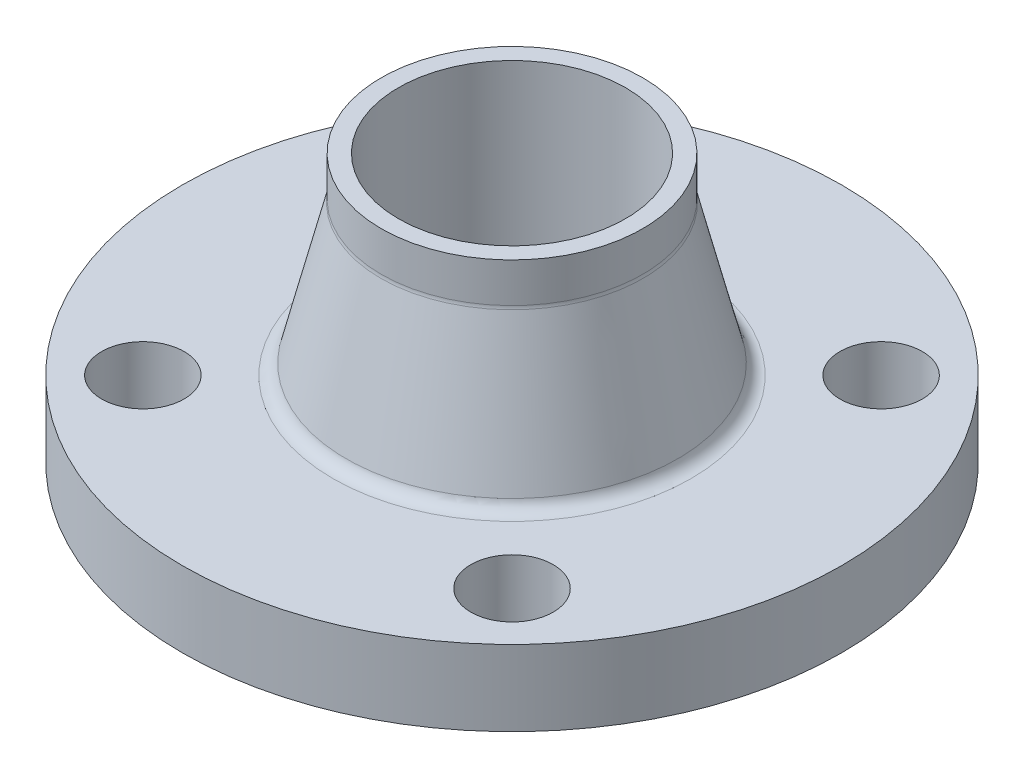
ISO-10303-21;
HEADER;
FILE_DESCRIPTION(('STEP AP214'),'2;1');
FILE_NAME('part.step','',(''),(''),'','','');
FILE_SCHEMA(('AUTOMOTIVE_DESIGN { 1 0 10303 214 1 1 1 1 }'));
ENDSEC;
DATA;
#1=APPLICATION_CONTEXT('core data for automotive mechanical design processes');
#2=APPLICATION_PROTOCOL_DEFINITION('international standard','automotive_design',2000,#1);
#3=PRODUCT_CONTEXT('',#1,'mechanical');
#4=PRODUCT('Part','Part','',(#3));
#5=PRODUCT_RELATED_PRODUCT_CATEGORY('part','',(#4));
#6=PRODUCT_DEFINITION_FORMATION('','',#4);
#7=PRODUCT_DEFINITION_CONTEXT('part definition',#1,'design');
#8=PRODUCT_DEFINITION('design','',#6,#7);
#9=PRODUCT_DEFINITION_SHAPE('','',#8);
#10=(LENGTH_UNIT() NAMED_UNIT(*) SI_UNIT(.MILLI.,.METRE.));
#11=(NAMED_UNIT(*) PLANE_ANGLE_UNIT() SI_UNIT($,.RADIAN.));
#12=(NAMED_UNIT(*) SI_UNIT($,.STERADIAN.) SOLID_ANGLE_UNIT());
#13=UNCERTAINTY_MEASURE_WITH_UNIT(LENGTH_MEASURE(1.E-05),#10,'distance_accuracy_value','');
#14=(GEOMETRIC_REPRESENTATION_CONTEXT(3) GLOBAL_UNCERTAINTY_ASSIGNED_CONTEXT((#13)) GLOBAL_UNIT_ASSIGNED_CONTEXT((#10,
#11,#12)) REPRESENTATION_CONTEXT('',''));
#15=CARTESIAN_POINT('',(0.,0.,0.));
#16=DIRECTION('',(0.,0.,1.));
#17=DIRECTION('',(1.,0.,0.));
#18=AXIS2_PLACEMENT_3D('',#15,#16,#17);
#19=CARTESIAN_POINT('',(30.226,61.9125,0.));
#20=DIRECTION('',(0.,1.,0.));
#21=DIRECTION('',(0.,0.,1.));
#22=AXIS2_PLACEMENT_3D('',#19,#20,#21);
#23=PLANE('',#22);
#24=CARTESIAN_POINT('',(0.,61.9125,0.));
#25=DIRECTION('',(0.,-1.,0.));
#26=DIRECTION('',(0.,0.,-1.));
#27=AXIS2_PLACEMENT_3D('',#24,#25,#26);
#28=CIRCLE('',#27,26.2509);
#29=CARTESIAN_POINT('',(0.,61.9125,-26.2509));
#30=VERTEX_POINT('',#29);
#31=EDGE_CURVE('E50',#30,#30,#28,.T.);
#32=ORIENTED_EDGE('',*,*,#31,.T.);
#33=EDGE_LOOP('',(#32));
#34=FACE_BOUND('',#33,.T.);
#35=CARTESIAN_POINT('',(0.,61.9125,0.));
#36=DIRECTION('',(0.,-1.,0.));
#37=DIRECTION('',(0.,0.,-1.));
#38=AXIS2_PLACEMENT_3D('',#35,#36,#37);
#39=CIRCLE('',#38,30.226);
#40=CARTESIAN_POINT('',(0.,61.9125,-30.226));
#41=VERTEX_POINT('',#40);
#42=EDGE_CURVE('E10',#41,#41,#39,.T.);
#43=ORIENTED_EDGE('',*,*,#42,.F.);
#44=EDGE_LOOP('',(#43));
#45=FACE_BOUND('',#44,.T.);
#46=ADVANCED_FACE('F31',(#34,#45),#23,.T.);
#47=CARTESIAN_POINT('',(0.,0.,0.));
#48=DIRECTION('',(0.,-1.,0.));
#49=DIRECTION('',(0.,0.,-1.));
#50=AXIS2_PLACEMENT_3D('',#47,#48,#49);
#51=CYLINDRICAL_SURFACE('',#50,30.226);
#52=ORIENTED_EDGE('',*,*,#42,.T.);
#53=EDGE_LOOP('',(#52));
#54=FACE_BOUND('',#53,.T.);
#55=CARTESIAN_POINT('',(0.,52.7756017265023,0.));
#56=DIRECTION('',(0.,-1.,0.));
#57=DIRECTION('',(0.,0.,-1.));
#58=AXIS2_PLACEMENT_3D('',#55,#56,#57);
#59=CIRCLE('',#58,30.226);
#60=CARTESIAN_POINT('',(0.,52.7756017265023,-30.226));
#61=VERTEX_POINT('',#60);
#62=EDGE_CURVE('E38',#61,#61,#59,.T.);
#63=ORIENTED_EDGE('',*,*,#62,.F.);
#64=EDGE_LOOP('',(#63));
#65=FACE_BOUND('',#64,.T.);
#66=ADVANCED_FACE('F102',(#54,#65),#51,.T.);
#67=CARTESIAN_POINT('',(0.,52.7756017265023,0.));
#68=DIRECTION('',(0.,-1.,0.));
#69=DIRECTION('',(0.,0.,-1.));
#70=AXIS2_PLACEMENT_3D('',#67,#68,#69);
#71=TOROIDAL_SURFACE('',#70,33.401,3.175);
#72=ORIENTED_EDGE('',*,*,#62,.T.);
#73=EDGE_LOOP('',(#72));
#74=FACE_BOUND('',#73,.T.);
#75=CARTESIAN_POINT('',(0.,52.0108254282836,0.));
#76=DIRECTION('',(0.,-1.,0.));
#77=DIRECTION('',(0.,0.,-1.));
#78=AXIS2_PLACEMENT_3D('',#75,#76,#77);
#79=CIRCLE('',#78,30.3194837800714);
#80=CARTESIAN_POINT('',(0.,52.0108254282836,-30.3194837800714));
#81=VERTEX_POINT('',#80);
#82=EDGE_CURVE('E43',#81,#81,#79,.T.);
#83=ORIENTED_EDGE('',*,*,#82,.F.);
#84=EDGE_LOOP('',(#83));
#85=FACE_BOUND('',#84,.T.);
#86=ADVANCED_FACE('F100',(#74,#85),#71,.F.);
#87=CARTESIAN_POINT('',(0.,19.8727237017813,0.));
#88=DIRECTION('',(0.,-1.,0.));
#89=DIRECTION('',(0.,0.,-1.));
#90=AXIS2_PLACEMENT_3D('',#87,#88,#89);
#91=CONICAL_SURFACE('',#90,38.295576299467,0.243266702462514);
#92=ORIENTED_EDGE('',*,*,#82,.T.);
#93=EDGE_LOOP('',(#92));
#94=FACE_BOUND('',#93,.T.);
#95=CARTESIAN_POINT('',(0.,19.8727237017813,0.));
#96=DIRECTION('',(0.,-1.,0.));
#97=DIRECTION('',(0.,0.,-1.));
#98=AXIS2_PLACEMENT_3D('',#95,#96,#97);
#99=CIRCLE('',#98,38.295576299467);
#100=CARTESIAN_POINT('',(0.,19.8727237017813,-38.295576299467));
#101=VERTEX_POINT('',#100);
#102=EDGE_CURVE('E92',#101,#101,#99,.T.);
#103=ORIENTED_EDGE('',*,*,#102,.F.);
#104=EDGE_LOOP('',(#103));
#105=FACE_BOUND('',#104,.T.);
#106=ADVANCED_FACE('F97',(#94,#105),#91,.T.);
#107=CARTESIAN_POINT('',(0.,20.6375,0.));
#108=DIRECTION('',(0.,-1.,0.));
#109=DIRECTION('',(0.,0.,-1.));
#110=AXIS2_PLACEMENT_3D('',#107,#108,#109);
#111=TOROIDAL_SURFACE('',#110,41.3770925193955,3.17499999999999);
#112=ORIENTED_EDGE('',*,*,#102,.T.);
#113=EDGE_LOOP('',(#112));
#114=FACE_BOUND('',#113,.T.);
#115=CARTESIAN_POINT('',(0.,17.4625,0.));
#116=DIRECTION('',(0.,-1.,0.));
#117=DIRECTION('',(0.,0.,-1.));
#118=AXIS2_PLACEMENT_3D('',#115,#116,#117);
#119=CIRCLE('',#118,41.3770925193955);
#120=CARTESIAN_POINT('',(0.,17.4625,-41.3770925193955));
#121=VERTEX_POINT('',#120);
#122=EDGE_CURVE('E89',#121,#121,#119,.T.);
#123=ORIENTED_EDGE('',*,*,#122,.F.);
#124=EDGE_LOOP('',(#123));
#125=FACE_BOUND('',#124,.T.);
#126=ADVANCED_FACE('F109',(#114,#125),#111,.F.);
#127=CARTESIAN_POINT('',(76.2,17.4625,0.));
#128=DIRECTION('',(0.,1.,0.));
#129=DIRECTION('',(0.,0.,1.));
#130=AXIS2_PLACEMENT_3D('',#127,#128,#129);
#131=PLANE('',#130);
#132=CARTESIAN_POINT('',(42.656216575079,17.4625,-42.656216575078));
#133=DIRECTION('',(0.,1.,0.));
#134=DIRECTION('',(1.,0.,0.));
#135=AXIS2_PLACEMENT_3D('',#132,#133,#134);
#136=CIRCLE('',#135,9.525);
#137=CARTESIAN_POINT('',(42.656216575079,17.4625,-33.131216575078));
#138=VERTEX_POINT('',#137);
#139=EDGE_CURVE('E67',#138,#138,#136,.T.);
#140=ORIENTED_EDGE('',*,*,#139,.F.);
#141=EDGE_LOOP('',(#140));
#142=FACE_BOUND('',#141,.T.);
#143=CARTESIAN_POINT('',(-42.6562165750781,17.4625,-42.6562165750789));
#144=DIRECTION('',(0.,1.,0.));
#145=DIRECTION('',(0.,0.,-1.));
#146=AXIS2_PLACEMENT_3D('',#143,#144,#145);
#147=CIRCLE('',#146,9.525);
#148=CARTESIAN_POINT('',(-42.6562165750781,17.4625,-33.1312165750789));
#149=VERTEX_POINT('',#148);
#150=EDGE_CURVE('E57',#149,#149,#147,.T.);
#151=ORIENTED_EDGE('',*,*,#150,.F.);
#152=EDGE_LOOP('',(#151));
#153=FACE_BOUND('',#152,.T.);
#154=CARTESIAN_POINT('',(-42.6562165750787,17.4625,42.6562165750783));
#155=DIRECTION('',(0.,1.,0.));
#156=DIRECTION('',(-1.,0.,0.));
#157=AXIS2_PLACEMENT_3D('',#154,#155,#156);
#158=CIRCLE('',#157,9.525);
#159=CARTESIAN_POINT('',(-42.6562165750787,17.4625,52.1812165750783));
#160=VERTEX_POINT('',#159);
#161=EDGE_CURVE('E54',#160,#160,#158,.T.);
#162=ORIENTED_EDGE('',*,*,#161,.F.);
#163=EDGE_LOOP('',(#162));
#164=FACE_BOUND('',#163,.T.);
#165=CARTESIAN_POINT('',(42.6562165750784,17.4625,42.6562165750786));
#166=DIRECTION('',(0.,1.,0.));
#167=DIRECTION('',(0.,0.,1.));
#168=AXIS2_PLACEMENT_3D('',#165,#166,#167);
#169=CIRCLE('',#168,9.525);
#170=CARTESIAN_POINT('',(42.6562165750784,17.4625,52.1812165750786));
#171=VERTEX_POINT('',#170);
#172=EDGE_CURVE('E51',#171,#171,#169,.T.);
#173=ORIENTED_EDGE('',*,*,#172,.F.);
#174=EDGE_LOOP('',(#173));
#175=FACE_BOUND('',#174,.T.);
#176=ORIENTED_EDGE('',*,*,#122,.T.);
#177=EDGE_LOOP('',(#176));
#178=FACE_BOUND('',#177,.T.);
#179=CARTESIAN_POINT('',(0.,17.4625,0.));
#180=DIRECTION('',(0.,-1.,0.));
#181=DIRECTION('',(0.,0.,-1.));
#182=AXIS2_PLACEMENT_3D('',#179,#180,#181);
#183=CIRCLE('',#182,76.2);
#184=CARTESIAN_POINT('',(0.,17.4625,-76.2));
#185=VERTEX_POINT('',#184);
#186=EDGE_CURVE('E86',#185,#185,#183,.T.);
#187=ORIENTED_EDGE('',*,*,#186,.F.);
#188=EDGE_LOOP('',(#187));
#189=FACE_BOUND('',#188,.T.);
#190=ADVANCED_FACE('F146',(#142,#153,#164,#175,#178,#189),#131,.T.);
#191=CARTESIAN_POINT('',(0.,0.,0.));
#192=DIRECTION('',(0.,-1.,0.));
#193=DIRECTION('',(0.,0.,-1.));
#194=AXIS2_PLACEMENT_3D('',#191,#192,#193);
#195=CYLINDRICAL_SURFACE('',#194,76.2);
#196=ORIENTED_EDGE('',*,*,#186,.T.);
#197=EDGE_LOOP('',(#196));
#198=FACE_BOUND('',#197,.T.);
#199=CARTESIAN_POINT('',(0.,0.,0.));
#200=DIRECTION('',(0.,-1.,0.));
#201=DIRECTION('',(0.,0.,-1.));
#202=AXIS2_PLACEMENT_3D('',#199,#200,#201);
#203=CIRCLE('',#202,76.2);
#204=CARTESIAN_POINT('',(0.,0.,-76.2));
#205=VERTEX_POINT('',#204);
#206=EDGE_CURVE('E83',#205,#205,#203,.T.);
#207=ORIENTED_EDGE('',*,*,#206,.F.);
#208=EDGE_LOOP('',(#207));
#209=FACE_BOUND('',#208,.T.);
#210=ADVANCED_FACE('F142',(#198,#209),#195,.T.);
#211=CARTESIAN_POINT('',(46.0375,0.,0.));
#212=DIRECTION('',(0.,-1.,0.));
#213=DIRECTION('',(0.,0.,-1.));
#214=AXIS2_PLACEMENT_3D('',#211,#212,#213);
#215=PLANE('',#214);
#216=CARTESIAN_POINT('',(42.656216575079,0.,-42.656216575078));
#217=DIRECTION('',(0.,-1.,0.));
#218=DIRECTION('',(0.,0.,-1.));
#219=AXIS2_PLACEMENT_3D('',#216,#217,#218);
#220=CIRCLE('',#219,9.525);
#221=CARTESIAN_POINT('',(42.656216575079,0.,-33.131216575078));
#222=VERTEX_POINT('',#221);
#223=EDGE_CURVE('E34',#222,#222,#220,.T.);
#224=ORIENTED_EDGE('',*,*,#223,.F.);
#225=EDGE_LOOP('',(#224));
#226=FACE_BOUND('',#225,.T.);
#227=CARTESIAN_POINT('',(-42.6562165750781,0.,-42.6562165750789));
#228=DIRECTION('',(0.,-1.,0.));
#229=DIRECTION('',(0.,0.,-1.));
#230=AXIS2_PLACEMENT_3D('',#227,#228,#229);
#231=CIRCLE('',#230,9.525);
#232=CARTESIAN_POINT('',(-42.6562165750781,0.,-33.1312165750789));
#233=VERTEX_POINT('',#232);
#234=EDGE_CURVE('E55',#233,#233,#231,.T.);
#235=ORIENTED_EDGE('',*,*,#234,.F.);
#236=EDGE_LOOP('',(#235));
#237=FACE_BOUND('',#236,.T.);
#238=CARTESIAN_POINT('',(-42.6562165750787,0.,42.6562165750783));
#239=DIRECTION('',(0.,-1.,0.));
#240=DIRECTION('',(0.,0.,-1.));
#241=AXIS2_PLACEMENT_3D('',#238,#239,#240);
#242=CIRCLE('',#241,9.525);
#243=CARTESIAN_POINT('',(-42.6562165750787,0.,52.1812165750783));
#244=VERTEX_POINT('',#243);
#245=EDGE_CURVE('E52',#244,#244,#242,.T.);
#246=ORIENTED_EDGE('',*,*,#245,.F.);
#247=EDGE_LOOP('',(#246));
#248=FACE_BOUND('',#247,.T.);
#249=CARTESIAN_POINT('',(42.6562165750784,0.,42.6562165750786));
#250=DIRECTION('',(0.,-1.,0.));
#251=DIRECTION('',(0.,0.,-1.));
#252=AXIS2_PLACEMENT_3D('',#249,#250,#251);
#253=CIRCLE('',#252,9.525);
#254=CARTESIAN_POINT('',(42.6562165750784,0.,52.1812165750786));
#255=VERTEX_POINT('',#254);
#256=EDGE_CURVE('E47',#255,#255,#253,.T.);
#257=ORIENTED_EDGE('',*,*,#256,.F.);
#258=EDGE_LOOP('',(#257));
#259=FACE_BOUND('',#258,.T.);
#260=ORIENTED_EDGE('',*,*,#206,.T.);
#261=EDGE_LOOP('',(#260));
#262=FACE_BOUND('',#261,.T.);
#263=CARTESIAN_POINT('',(0.,0.,0.));
#264=DIRECTION('',(0.,-1.,0.));
#265=DIRECTION('',(0.,0.,-1.));
#266=AXIS2_PLACEMENT_3D('',#263,#264,#265);
#267=CIRCLE('',#266,46.0375);
#268=CARTESIAN_POINT('',(0.,0.,-46.0375));
#269=VERTEX_POINT('',#268);
#270=EDGE_CURVE('E80',#269,#269,#267,.T.);
#271=ORIENTED_EDGE('',*,*,#270,.F.);
#272=EDGE_LOOP('',(#271));
#273=FACE_BOUND('',#272,.T.);
#274=ADVANCED_FACE('F138',(#226,#237,#248,#259,#262,#273),#215,.T.);
#275=CARTESIAN_POINT('',(0.,0.,0.));
#276=DIRECTION('',(0.,-1.,0.));
#277=DIRECTION('',(0.,0.,-1.));
#278=AXIS2_PLACEMENT_3D('',#275,#276,#277);
#279=CYLINDRICAL_SURFACE('',#278,46.0375);
#280=ORIENTED_EDGE('',*,*,#270,.T.);
#281=EDGE_LOOP('',(#280));
#282=FACE_BOUND('',#281,.T.);
#283=CARTESIAN_POINT('',(0.,-1.5875,0.));
#284=DIRECTION('',(0.,-1.,0.));
#285=DIRECTION('',(0.,0.,-1.));
#286=AXIS2_PLACEMENT_3D('',#283,#284,#285);
#287=CIRCLE('',#286,46.0375);
#288=CARTESIAN_POINT('',(0.,-1.5875,-46.0375));
#289=VERTEX_POINT('',#288);
#290=EDGE_CURVE('E77',#289,#289,#287,.T.);
#291=ORIENTED_EDGE('',*,*,#290,.F.);
#292=EDGE_LOOP('',(#291));
#293=FACE_BOUND('',#292,.T.);
#294=ADVANCED_FACE('F131',(#282,#293),#279,.T.);
#295=CARTESIAN_POINT('',(26.2509,-1.5875,0.));
#296=DIRECTION('',(0.,-1.,0.));
#297=DIRECTION('',(0.,0.,-1.));
#298=AXIS2_PLACEMENT_3D('',#295,#296,#297);
#299=PLANE('',#298);
#300=ORIENTED_EDGE('',*,*,#290,.T.);
#301=EDGE_LOOP('',(#300));
#302=FACE_BOUND('',#301,.T.);
#303=CARTESIAN_POINT('',(0.,-1.58750000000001,0.));
#304=DIRECTION('',(0.,-1.,0.));
#305=DIRECTION('',(0.,0.,-1.));
#306=AXIS2_PLACEMENT_3D('',#303,#304,#305);
#307=CIRCLE('',#306,26.2509);
#308=CARTESIAN_POINT('',(0.,-1.58750000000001,-26.2509));
#309=VERTEX_POINT('',#308);
#310=EDGE_CURVE('E74',#309,#309,#307,.T.);
#311=ORIENTED_EDGE('',*,*,#310,.F.);
#312=EDGE_LOOP('',(#311));
#313=FACE_BOUND('',#312,.T.);
#314=ADVANCED_FACE('F121',(#302,#313),#299,.T.);
#315=CARTESIAN_POINT('',(0.,0.,0.));
#316=DIRECTION('',(0.,-1.,0.));
#317=DIRECTION('',(0.,0.,-1.));
#318=AXIS2_PLACEMENT_3D('',#315,#316,#317);
#319=CYLINDRICAL_SURFACE('',#318,26.2509);
#320=ORIENTED_EDGE('',*,*,#310,.T.);
#321=EDGE_LOOP('',(#320));
#322=FACE_BOUND('',#321,.T.);
#323=ORIENTED_EDGE('',*,*,#31,.F.);
#324=EDGE_LOOP('',(#323));
#325=FACE_BOUND('',#324,.T.);
#326=ADVANCED_FACE('F118',(#322,#325),#319,.F.);
#327=CARTESIAN_POINT('',(42.6562165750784,-1.58750000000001,42.6562165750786));
#328=DIRECTION('',(0.,1.,0.));
#329=DIRECTION('',(0.,0.,1.));
#330=AXIS2_PLACEMENT_3D('',#327,#328,#329);
#331=CYLINDRICAL_SURFACE('',#330,9.525);
#332=CARTESIAN_POINT('',(42.6562165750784,0.,52.1812165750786));
#333=CARTESIAN_POINT('',(42.6562165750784,0.181901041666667,52.1812165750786));
#334=CARTESIAN_POINT('',(42.6562165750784,0.363802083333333,52.1812165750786));
#335=CARTESIAN_POINT('',(42.6562165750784,0.727604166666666,52.1812165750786));
#336=CARTESIAN_POINT('',(42.6562165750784,0.909505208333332,52.1812165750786));
#337=CARTESIAN_POINT('',(42.6562165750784,1.27330729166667,52.1812165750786));
#338=CARTESIAN_POINT('',(42.6562165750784,1.45520833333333,52.1812165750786));
#339=CARTESIAN_POINT('',(42.6562165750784,1.81901041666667,52.1812165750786));
#340=CARTESIAN_POINT('',(42.6562165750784,2.00091145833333,52.1812165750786));
#341=CARTESIAN_POINT('',(42.6562165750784,2.36471354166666,52.1812165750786));
#342=CARTESIAN_POINT('',(42.6562165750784,2.54661458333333,52.1812165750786));
#343=CARTESIAN_POINT('',(42.6562165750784,2.91041666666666,52.1812165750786));
#344=CARTESIAN_POINT('',(42.6562165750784,3.09231770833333,52.1812165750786));
#345=CARTESIAN_POINT('',(42.6562165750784,3.45611979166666,52.1812165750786));
#346=CARTESIAN_POINT('',(42.6562165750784,3.63802083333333,52.1812165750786));
#347=CARTESIAN_POINT('',(42.6562165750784,4.00182291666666,52.1812165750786));
#348=CARTESIAN_POINT('',(42.6562165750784,4.18372395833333,52.1812165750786));
#349=CARTESIAN_POINT('',(42.6562165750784,4.54752604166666,52.1812165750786));
#350=CARTESIAN_POINT('',(42.6562165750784,4.72942708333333,52.1812165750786));
#351=CARTESIAN_POINT('',(42.6562165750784,5.09322916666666,52.1812165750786));
#352=CARTESIAN_POINT('',(42.6562165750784,5.27513020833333,52.1812165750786));
#353=CARTESIAN_POINT('',(42.6562165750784,5.63893229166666,52.1812165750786));
#354=CARTESIAN_POINT('',(42.6562165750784,5.82083333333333,52.1812165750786));
#355=CARTESIAN_POINT('',(42.6562165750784,6.18463541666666,52.1812165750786));
#356=CARTESIAN_POINT('',(42.6562165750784,6.36653645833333,52.1812165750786));
#357=CARTESIAN_POINT('',(42.6562165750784,6.73033854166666,52.1812165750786));
#358=CARTESIAN_POINT('',(42.6562165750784,6.91223958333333,52.1812165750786));
#359=CARTESIAN_POINT('',(42.6562165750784,7.27604166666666,52.1812165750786));
#360=CARTESIAN_POINT('',(42.6562165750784,7.45794270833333,52.1812165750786));
#361=CARTESIAN_POINT('',(42.6562165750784,7.82174479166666,52.1812165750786));
#362=CARTESIAN_POINT('',(42.6562165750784,8.00364583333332,52.1812165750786));
#363=CARTESIAN_POINT('',(42.6562165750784,8.36744791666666,52.1812165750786));
#364=CARTESIAN_POINT('',(42.6562165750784,8.54934895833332,52.1812165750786));
#365=CARTESIAN_POINT('',(42.6562165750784,8.91315104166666,52.1812165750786));
#366=CARTESIAN_POINT('',(42.6562165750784,9.09505208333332,52.1812165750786));
#367=CARTESIAN_POINT('',(42.6562165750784,9.45885416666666,52.1812165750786));
#368=CARTESIAN_POINT('',(42.6562165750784,9.64075520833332,52.1812165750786));
#369=CARTESIAN_POINT('',(42.6562165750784,10.0045572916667,52.1812165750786));
#370=CARTESIAN_POINT('',(42.6562165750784,10.1864583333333,52.1812165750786));
#371=CARTESIAN_POINT('',(42.6562165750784,10.5502604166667,52.1812165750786));
#372=CARTESIAN_POINT('',(42.6562165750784,10.7321614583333,52.1812165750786));
#373=CARTESIAN_POINT('',(42.6562165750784,11.0959635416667,52.1812165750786));
#374=CARTESIAN_POINT('',(42.6562165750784,11.2778645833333,52.1812165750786));
#375=CARTESIAN_POINT('',(42.6562165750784,11.6416666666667,52.1812165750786));
#376=CARTESIAN_POINT('',(42.6562165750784,11.8235677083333,52.1812165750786));
#377=CARTESIAN_POINT('',(42.6562165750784,12.1873697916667,52.1812165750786));
#378=CARTESIAN_POINT('',(42.6562165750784,12.3692708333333,52.1812165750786));
#379=CARTESIAN_POINT('',(42.6562165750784,12.7330729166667,52.1812165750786));
#380=CARTESIAN_POINT('',(42.6562165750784,12.9149739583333,52.1812165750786));
#381=CARTESIAN_POINT('',(42.6562165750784,13.2787760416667,52.1812165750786));
#382=CARTESIAN_POINT('',(42.6562165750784,13.4606770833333,52.1812165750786));
#383=CARTESIAN_POINT('',(42.6562165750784,13.8244791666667,52.1812165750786));
#384=CARTESIAN_POINT('',(42.6562165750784,14.0063802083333,52.1812165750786));
#385=CARTESIAN_POINT('',(42.6562165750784,14.3701822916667,52.1812165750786));
#386=CARTESIAN_POINT('',(42.6562165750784,14.5520833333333,52.1812165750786));
#387=CARTESIAN_POINT('',(42.6562165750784,14.9158854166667,52.1812165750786));
#388=CARTESIAN_POINT('',(42.6562165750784,15.0977864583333,52.1812165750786));
#389=CARTESIAN_POINT('',(42.6562165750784,15.4615885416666,52.1812165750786));
#390=CARTESIAN_POINT('',(42.6562165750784,15.6434895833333,52.1812165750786));
#391=CARTESIAN_POINT('',(42.6562165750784,16.0072916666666,52.1812165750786));
#392=CARTESIAN_POINT('',(42.6562165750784,16.1891927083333,52.1812165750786));
#393=CARTESIAN_POINT('',(42.6562165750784,16.5529947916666,52.1812165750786));
#394=CARTESIAN_POINT('',(42.6562165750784,16.7348958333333,52.1812165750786));
#395=CARTESIAN_POINT('',(42.6562165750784,17.0986979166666,52.1812165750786));
#396=CARTESIAN_POINT('',(42.6562165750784,17.2805989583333,52.1812165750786));
#397=CARTESIAN_POINT('',(42.6562165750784,17.4625,52.1812165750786));
#398=B_SPLINE_CURVE_WITH_KNOTS('',3,(#332,#333,#334,#335,#336,#337,#338,#339,#340,#341,#342,
#343,#344,#345,#346,#347,#348,#349,#350,#351,#352,#353,#354,#355,#356,#357,#358,#359,#360,#361,
#362,#363,#364,#365,#366,#367,#368,#369,#370,#371,#372,#373,#374,#375,#376,#377,#378,#379,#380,
#381,#382,#383,#384,#385,#386,#387,#388,#389,#390,#391,#392,#393,#394,#395,#396,#397),
.UNSPECIFIED.,.F.,.F.,(4,2,2,2,2,2,2,2,2,2,2,2,2,2,2,2,2,2,2,2,2,2,2,2,2,2,2,2,2,2,2,2,4),(0.,
0.545703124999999,1.09140625,1.637109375,2.1828125,2.728515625,3.27421875,3.819921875,4.365625,
4.911328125,5.45703124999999,6.00273437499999,6.54843749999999,7.09414062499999,
7.63984374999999,8.18554687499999,8.73124999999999,9.27695312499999,9.82265624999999,
10.368359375,10.9140625,11.459765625,12.00546875,12.551171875,13.096875,13.642578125,
14.18828125,14.733984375,15.2796875,15.825390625,16.37109375,16.916796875,17.4625),.UNSPECIFIED.);
#399=EDGE_CURVE('BSEAM120',#255,#171,#398,.T.);
#400=ORIENTED_EDGE('',*,*,#256,.T.);
#401=ORIENTED_EDGE('',*,*,#172,.T.);
#402=ORIENTED_EDGE('',*,*,#399,.T.);
#403=ORIENTED_EDGE('',*,*,#399,.F.);
#404=EDGE_LOOP('',(#400,#402,#401,#403));
#405=FACE_BOUND('',#404,.T.);
#406=ADVANCED_FACE('F120',(#405),#331,.F.);
#407=CARTESIAN_POINT('',(-42.6562165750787,-1.58750000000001,42.6562165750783));
#408=DIRECTION('',(0.,1.,0.));
#409=DIRECTION('',(0.,0.,1.));
#410=AXIS2_PLACEMENT_3D('',#407,#408,#409);
#411=CYLINDRICAL_SURFACE('',#410,9.525);
#412=CARTESIAN_POINT('',(-42.6562165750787,0.,52.1812165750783));
#413=CARTESIAN_POINT('',(-42.6562165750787,0.181901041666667,52.1812165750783));
#414=CARTESIAN_POINT('',(-42.6562165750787,0.363802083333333,52.1812165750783));
#415=CARTESIAN_POINT('',(-42.6562165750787,0.727604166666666,52.1812165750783));
#416=CARTESIAN_POINT('',(-42.6562165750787,0.909505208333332,52.1812165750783));
#417=CARTESIAN_POINT('',(-42.6562165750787,1.27330729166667,52.1812165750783));
#418=CARTESIAN_POINT('',(-42.6562165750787,1.45520833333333,52.1812165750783));
#419=CARTESIAN_POINT('',(-42.6562165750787,1.81901041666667,52.1812165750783));
#420=CARTESIAN_POINT('',(-42.6562165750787,2.00091145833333,52.1812165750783));
#421=CARTESIAN_POINT('',(-42.6562165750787,2.36471354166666,52.1812165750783));
#422=CARTESIAN_POINT('',(-42.6562165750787,2.54661458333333,52.1812165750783));
#423=CARTESIAN_POINT('',(-42.6562165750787,2.91041666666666,52.1812165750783));
#424=CARTESIAN_POINT('',(-42.6562165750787,3.09231770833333,52.1812165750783));
#425=CARTESIAN_POINT('',(-42.6562165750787,3.45611979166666,52.1812165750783));
#426=CARTESIAN_POINT('',(-42.6562165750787,3.63802083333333,52.1812165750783));
#427=CARTESIAN_POINT('',(-42.6562165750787,4.00182291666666,52.1812165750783));
#428=CARTESIAN_POINT('',(-42.6562165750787,4.18372395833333,52.1812165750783));
#429=CARTESIAN_POINT('',(-42.6562165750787,4.54752604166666,52.1812165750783));
#430=CARTESIAN_POINT('',(-42.6562165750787,4.72942708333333,52.1812165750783));
#431=CARTESIAN_POINT('',(-42.6562165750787,5.09322916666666,52.1812165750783));
#432=CARTESIAN_POINT('',(-42.6562165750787,5.27513020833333,52.1812165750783));
#433=CARTESIAN_POINT('',(-42.6562165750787,5.63893229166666,52.1812165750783));
#434=CARTESIAN_POINT('',(-42.6562165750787,5.82083333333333,52.1812165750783));
#435=CARTESIAN_POINT('',(-42.6562165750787,6.18463541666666,52.1812165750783));
#436=CARTESIAN_POINT('',(-42.6562165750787,6.36653645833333,52.1812165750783));
#437=CARTESIAN_POINT('',(-42.6562165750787,6.73033854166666,52.1812165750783));
#438=CARTESIAN_POINT('',(-42.6562165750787,6.91223958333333,52.1812165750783));
#439=CARTESIAN_POINT('',(-42.6562165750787,7.27604166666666,52.1812165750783));
#440=CARTESIAN_POINT('',(-42.6562165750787,7.45794270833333,52.1812165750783));
#441=CARTESIAN_POINT('',(-42.6562165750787,7.82174479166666,52.1812165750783));
#442=CARTESIAN_POINT('',(-42.6562165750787,8.00364583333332,52.1812165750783));
#443=CARTESIAN_POINT('',(-42.6562165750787,8.36744791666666,52.1812165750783));
#444=CARTESIAN_POINT('',(-42.6562165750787,8.54934895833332,52.1812165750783));
#445=CARTESIAN_POINT('',(-42.6562165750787,8.91315104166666,52.1812165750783));
#446=CARTESIAN_POINT('',(-42.6562165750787,9.09505208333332,52.1812165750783));
#447=CARTESIAN_POINT('',(-42.6562165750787,9.45885416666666,52.1812165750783));
#448=CARTESIAN_POINT('',(-42.6562165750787,9.64075520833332,52.1812165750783));
#449=CARTESIAN_POINT('',(-42.6562165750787,10.0045572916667,52.1812165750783));
#450=CARTESIAN_POINT('',(-42.6562165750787,10.1864583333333,52.1812165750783));
#451=CARTESIAN_POINT('',(-42.6562165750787,10.5502604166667,52.1812165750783));
#452=CARTESIAN_POINT('',(-42.6562165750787,10.7321614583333,52.1812165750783));
#453=CARTESIAN_POINT('',(-42.6562165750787,11.0959635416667,52.1812165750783));
#454=CARTESIAN_POINT('',(-42.6562165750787,11.2778645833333,52.1812165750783));
#455=CARTESIAN_POINT('',(-42.6562165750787,11.6416666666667,52.1812165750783));
#456=CARTESIAN_POINT('',(-42.6562165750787,11.8235677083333,52.1812165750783));
#457=CARTESIAN_POINT('',(-42.6562165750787,12.1873697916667,52.1812165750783));
#458=CARTESIAN_POINT('',(-42.6562165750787,12.3692708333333,52.1812165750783));
#459=CARTESIAN_POINT('',(-42.6562165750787,12.7330729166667,52.1812165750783));
#460=CARTESIAN_POINT('',(-42.6562165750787,12.9149739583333,52.1812165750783));
#461=CARTESIAN_POINT('',(-42.6562165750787,13.2787760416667,52.1812165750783));
#462=CARTESIAN_POINT('',(-42.6562165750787,13.4606770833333,52.1812165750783));
#463=CARTESIAN_POINT('',(-42.6562165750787,13.8244791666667,52.1812165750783));
#464=CARTESIAN_POINT('',(-42.6562165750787,14.0063802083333,52.1812165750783));
#465=CARTESIAN_POINT('',(-42.6562165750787,14.3701822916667,52.1812165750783));
#466=CARTESIAN_POINT('',(-42.6562165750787,14.5520833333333,52.1812165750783));
#467=CARTESIAN_POINT('',(-42.6562165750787,14.9158854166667,52.1812165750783));
#468=CARTESIAN_POINT('',(-42.6562165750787,15.0977864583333,52.1812165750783));
#469=CARTESIAN_POINT('',(-42.6562165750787,15.4615885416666,52.1812165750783));
#470=CARTESIAN_POINT('',(-42.6562165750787,15.6434895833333,52.1812165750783));
#471=CARTESIAN_POINT('',(-42.6562165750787,16.0072916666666,52.1812165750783));
#472=CARTESIAN_POINT('',(-42.6562165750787,16.1891927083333,52.1812165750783));
#473=CARTESIAN_POINT('',(-42.6562165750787,16.5529947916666,52.1812165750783));
#474=CARTESIAN_POINT('',(-42.6562165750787,16.7348958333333,52.1812165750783));
#475=CARTESIAN_POINT('',(-42.6562165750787,17.0986979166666,52.1812165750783));
#476=CARTESIAN_POINT('',(-42.6562165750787,17.2805989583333,52.1812165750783));
#477=CARTESIAN_POINT('',(-42.6562165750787,17.4625,52.1812165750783));
#478=B_SPLINE_CURVE_WITH_KNOTS('',3,(#412,#413,#414,#415,#416,#417,#418,#419,#420,#421,#422,
#423,#424,#425,#426,#427,#428,#429,#430,#431,#432,#433,#434,#435,#436,#437,#438,#439,#440,#441,
#442,#443,#444,#445,#446,#447,#448,#449,#450,#451,#452,#453,#454,#455,#456,#457,#458,#459,#460,
#461,#462,#463,#464,#465,#466,#467,#468,#469,#470,#471,#472,#473,#474,#475,#476,#477),
.UNSPECIFIED.,.F.,.F.,(4,2,2,2,2,2,2,2,2,2,2,2,2,2,2,2,2,2,2,2,2,2,2,2,2,2,2,2,2,2,2,2,4),(0.,
0.545703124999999,1.09140625,1.637109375,2.1828125,2.728515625,3.27421875,3.819921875,4.365625,
4.911328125,5.45703124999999,6.00273437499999,6.54843749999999,7.09414062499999,
7.63984374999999,8.18554687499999,8.73124999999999,9.27695312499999,9.82265624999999,
10.368359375,10.9140625,11.459765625,12.00546875,12.551171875,13.096875,13.642578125,
14.18828125,14.733984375,15.2796875,15.825390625,16.37109375,16.916796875,17.4625),.UNSPECIFIED.);
#479=EDGE_CURVE('BSEAM128',#244,#160,#478,.T.);
#480=ORIENTED_EDGE('',*,*,#245,.T.);
#481=ORIENTED_EDGE('',*,*,#161,.T.);
#482=ORIENTED_EDGE('',*,*,#479,.T.);
#483=ORIENTED_EDGE('',*,*,#479,.F.);
#484=EDGE_LOOP('',(#480,#482,#481,#483));
#485=FACE_BOUND('',#484,.T.);
#486=ADVANCED_FACE('F128',(#485),#411,.F.);
#487=CARTESIAN_POINT('',(-42.6562165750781,-1.58750000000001,-42.6562165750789));
#488=DIRECTION('',(0.,1.,0.));
#489=DIRECTION('',(0.,0.,1.));
#490=AXIS2_PLACEMENT_3D('',#487,#488,#489);
#491=CYLINDRICAL_SURFACE('',#490,9.525);
#492=CARTESIAN_POINT('',(-42.6562165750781,0.,-33.1312165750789));
#493=CARTESIAN_POINT('',(-42.6562165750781,0.181901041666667,-33.1312165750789));
#494=CARTESIAN_POINT('',(-42.6562165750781,0.363802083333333,-33.1312165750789));
#495=CARTESIAN_POINT('',(-42.6562165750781,0.727604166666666,-33.1312165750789));
#496=CARTESIAN_POINT('',(-42.6562165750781,0.909505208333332,-33.1312165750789));
#497=CARTESIAN_POINT('',(-42.6562165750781,1.27330729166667,-33.1312165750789));
#498=CARTESIAN_POINT('',(-42.6562165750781,1.45520833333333,-33.1312165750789));
#499=CARTESIAN_POINT('',(-42.6562165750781,1.81901041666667,-33.1312165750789));
#500=CARTESIAN_POINT('',(-42.6562165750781,2.00091145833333,-33.1312165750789));
#501=CARTESIAN_POINT('',(-42.6562165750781,2.36471354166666,-33.1312165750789));
#502=CARTESIAN_POINT('',(-42.6562165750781,2.54661458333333,-33.1312165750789));
#503=CARTESIAN_POINT('',(-42.6562165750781,2.91041666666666,-33.1312165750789));
#504=CARTESIAN_POINT('',(-42.6562165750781,3.09231770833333,-33.1312165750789));
#505=CARTESIAN_POINT('',(-42.6562165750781,3.45611979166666,-33.1312165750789));
#506=CARTESIAN_POINT('',(-42.6562165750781,3.63802083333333,-33.1312165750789));
#507=CARTESIAN_POINT('',(-42.6562165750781,4.00182291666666,-33.1312165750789));
#508=CARTESIAN_POINT('',(-42.6562165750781,4.18372395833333,-33.1312165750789));
#509=CARTESIAN_POINT('',(-42.6562165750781,4.54752604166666,-33.1312165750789));
#510=CARTESIAN_POINT('',(-42.6562165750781,4.72942708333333,-33.1312165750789));
#511=CARTESIAN_POINT('',(-42.6562165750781,5.09322916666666,-33.1312165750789));
#512=CARTESIAN_POINT('',(-42.6562165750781,5.27513020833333,-33.1312165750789));
#513=CARTESIAN_POINT('',(-42.6562165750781,5.63893229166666,-33.1312165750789));
#514=CARTESIAN_POINT('',(-42.6562165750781,5.82083333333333,-33.1312165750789));
#515=CARTESIAN_POINT('',(-42.6562165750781,6.18463541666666,-33.1312165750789));
#516=CARTESIAN_POINT('',(-42.6562165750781,6.36653645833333,-33.1312165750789));
#517=CARTESIAN_POINT('',(-42.6562165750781,6.73033854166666,-33.1312165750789));
#518=CARTESIAN_POINT('',(-42.6562165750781,6.91223958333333,-33.1312165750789));
#519=CARTESIAN_POINT('',(-42.6562165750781,7.27604166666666,-33.1312165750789));
#520=CARTESIAN_POINT('',(-42.6562165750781,7.45794270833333,-33.1312165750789));
#521=CARTESIAN_POINT('',(-42.6562165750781,7.82174479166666,-33.1312165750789));
#522=CARTESIAN_POINT('',(-42.6562165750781,8.00364583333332,-33.1312165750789));
#523=CARTESIAN_POINT('',(-42.6562165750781,8.36744791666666,-33.1312165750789));
#524=CARTESIAN_POINT('',(-42.6562165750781,8.54934895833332,-33.1312165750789));
#525=CARTESIAN_POINT('',(-42.6562165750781,8.91315104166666,-33.1312165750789));
#526=CARTESIAN_POINT('',(-42.6562165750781,9.09505208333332,-33.1312165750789));
#527=CARTESIAN_POINT('',(-42.6562165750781,9.45885416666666,-33.1312165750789));
#528=CARTESIAN_POINT('',(-42.6562165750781,9.64075520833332,-33.1312165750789));
#529=CARTESIAN_POINT('',(-42.6562165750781,10.0045572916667,-33.1312165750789));
#530=CARTESIAN_POINT('',(-42.6562165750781,10.1864583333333,-33.1312165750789));
#531=CARTESIAN_POINT('',(-42.6562165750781,10.5502604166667,-33.1312165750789));
#532=CARTESIAN_POINT('',(-42.6562165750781,10.7321614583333,-33.1312165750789));
#533=CARTESIAN_POINT('',(-42.6562165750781,11.0959635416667,-33.1312165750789));
#534=CARTESIAN_POINT('',(-42.6562165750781,11.2778645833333,-33.1312165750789));
#535=CARTESIAN_POINT('',(-42.6562165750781,11.6416666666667,-33.1312165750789));
#536=CARTESIAN_POINT('',(-42.6562165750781,11.8235677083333,-33.1312165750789));
#537=CARTESIAN_POINT('',(-42.6562165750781,12.1873697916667,-33.1312165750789));
#538=CARTESIAN_POINT('',(-42.6562165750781,12.3692708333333,-33.1312165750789));
#539=CARTESIAN_POINT('',(-42.6562165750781,12.7330729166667,-33.1312165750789));
#540=CARTESIAN_POINT('',(-42.6562165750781,12.9149739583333,-33.1312165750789));
#541=CARTESIAN_POINT('',(-42.6562165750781,13.2787760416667,-33.1312165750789));
#542=CARTESIAN_POINT('',(-42.6562165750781,13.4606770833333,-33.1312165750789));
#543=CARTESIAN_POINT('',(-42.6562165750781,13.8244791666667,-33.1312165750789));
#544=CARTESIAN_POINT('',(-42.6562165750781,14.0063802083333,-33.1312165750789));
#545=CARTESIAN_POINT('',(-42.6562165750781,14.3701822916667,-33.1312165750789));
#546=CARTESIAN_POINT('',(-42.6562165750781,14.5520833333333,-33.1312165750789));
#547=CARTESIAN_POINT('',(-42.6562165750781,14.9158854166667,-33.1312165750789));
#548=CARTESIAN_POINT('',(-42.6562165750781,15.0977864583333,-33.1312165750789));
#549=CARTESIAN_POINT('',(-42.6562165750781,15.4615885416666,-33.1312165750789));
#550=CARTESIAN_POINT('',(-42.6562165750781,15.6434895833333,-33.1312165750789));
#551=CARTESIAN_POINT('',(-42.6562165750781,16.0072916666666,-33.1312165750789));
#552=CARTESIAN_POINT('',(-42.6562165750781,16.1891927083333,-33.1312165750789));
#553=CARTESIAN_POINT('',(-42.6562165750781,16.5529947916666,-33.1312165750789));
#554=CARTESIAN_POINT('',(-42.6562165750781,16.7348958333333,-33.1312165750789));
#555=CARTESIAN_POINT('',(-42.6562165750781,17.0986979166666,-33.1312165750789));
#556=CARTESIAN_POINT('',(-42.6562165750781,17.2805989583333,-33.1312165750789));
#557=CARTESIAN_POINT('',(-42.6562165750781,17.4625,-33.1312165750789));
#558=B_SPLINE_CURVE_WITH_KNOTS('',3,(#492,#493,#494,#495,#496,#497,#498,#499,#500,#501,#502,
#503,#504,#505,#506,#507,#508,#509,#510,#511,#512,#513,#514,#515,#516,#517,#518,#519,#520,#521,
#522,#523,#524,#525,#526,#527,#528,#529,#530,#531,#532,#533,#534,#535,#536,#537,#538,#539,#540,
#541,#542,#543,#544,#545,#546,#547,#548,#549,#550,#551,#552,#553,#554,#555,#556,#557),
.UNSPECIFIED.,.F.,.F.,(4,2,2,2,2,2,2,2,2,2,2,2,2,2,2,2,2,2,2,2,2,2,2,2,2,2,2,2,2,2,2,2,4),(0.,
0.545703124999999,1.09140625,1.637109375,2.1828125,2.728515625,3.27421875,3.819921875,4.365625,
4.911328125,5.45703124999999,6.00273437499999,6.54843749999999,7.09414062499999,
7.63984374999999,8.18554687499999,8.73124999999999,9.27695312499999,9.82265624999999,
10.368359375,10.9140625,11.459765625,12.00546875,12.551171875,13.096875,13.642578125,
14.18828125,14.733984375,15.2796875,15.825390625,16.37109375,16.916796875,17.4625),.UNSPECIFIED.);
#559=EDGE_CURVE('BSEAM211',#233,#149,#558,.T.);
#560=ORIENTED_EDGE('',*,*,#234,.T.);
#561=ORIENTED_EDGE('',*,*,#150,.T.);
#562=ORIENTED_EDGE('',*,*,#559,.T.);
#563=ORIENTED_EDGE('',*,*,#559,.F.);
#564=EDGE_LOOP('',(#560,#562,#561,#563));
#565=FACE_BOUND('',#564,.T.);
#566=ADVANCED_FACE('F211',(#565),#491,.F.);
#567=CARTESIAN_POINT('',(42.656216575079,-1.58750000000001,-42.656216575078));
#568=DIRECTION('',(0.,1.,0.));
#569=DIRECTION('',(0.,0.,1.));
#570=AXIS2_PLACEMENT_3D('',#567,#568,#569);
#571=CYLINDRICAL_SURFACE('',#570,9.525);
#572=CARTESIAN_POINT('',(42.656216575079,0.,-33.131216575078));
#573=CARTESIAN_POINT('',(42.656216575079,0.181901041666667,-33.131216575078));
#574=CARTESIAN_POINT('',(42.656216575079,0.363802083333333,-33.131216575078));
#575=CARTESIAN_POINT('',(42.656216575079,0.727604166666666,-33.131216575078));
#576=CARTESIAN_POINT('',(42.656216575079,0.909505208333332,-33.131216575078));
#577=CARTESIAN_POINT('',(42.656216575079,1.27330729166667,-33.131216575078));
#578=CARTESIAN_POINT('',(42.656216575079,1.45520833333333,-33.131216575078));
#579=CARTESIAN_POINT('',(42.656216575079,1.81901041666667,-33.131216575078));
#580=CARTESIAN_POINT('',(42.656216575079,2.00091145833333,-33.131216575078));
#581=CARTESIAN_POINT('',(42.656216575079,2.36471354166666,-33.131216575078));
#582=CARTESIAN_POINT('',(42.656216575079,2.54661458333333,-33.131216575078));
#583=CARTESIAN_POINT('',(42.656216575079,2.91041666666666,-33.131216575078));
#584=CARTESIAN_POINT('',(42.656216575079,3.09231770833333,-33.131216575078));
#585=CARTESIAN_POINT('',(42.656216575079,3.45611979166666,-33.131216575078));
#586=CARTESIAN_POINT('',(42.656216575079,3.63802083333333,-33.131216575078));
#587=CARTESIAN_POINT('',(42.656216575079,4.00182291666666,-33.131216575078));
#588=CARTESIAN_POINT('',(42.656216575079,4.18372395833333,-33.131216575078));
#589=CARTESIAN_POINT('',(42.656216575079,4.54752604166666,-33.131216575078));
#590=CARTESIAN_POINT('',(42.656216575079,4.72942708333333,-33.131216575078));
#591=CARTESIAN_POINT('',(42.656216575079,5.09322916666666,-33.131216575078));
#592=CARTESIAN_POINT('',(42.656216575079,5.27513020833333,-33.131216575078));
#593=CARTESIAN_POINT('',(42.656216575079,5.63893229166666,-33.131216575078));
#594=CARTESIAN_POINT('',(42.656216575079,5.82083333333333,-33.131216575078));
#595=CARTESIAN_POINT('',(42.656216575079,6.18463541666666,-33.131216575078));
#596=CARTESIAN_POINT('',(42.656216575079,6.36653645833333,-33.131216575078));
#597=CARTESIAN_POINT('',(42.656216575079,6.73033854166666,-33.131216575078));
#598=CARTESIAN_POINT('',(42.656216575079,6.91223958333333,-33.131216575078));
#599=CARTESIAN_POINT('',(42.656216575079,7.27604166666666,-33.131216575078));
#600=CARTESIAN_POINT('',(42.656216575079,7.45794270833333,-33.131216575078));
#601=CARTESIAN_POINT('',(42.656216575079,7.82174479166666,-33.131216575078));
#602=CARTESIAN_POINT('',(42.656216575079,8.00364583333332,-33.131216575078));
#603=CARTESIAN_POINT('',(42.656216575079,8.36744791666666,-33.131216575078));
#604=CARTESIAN_POINT('',(42.656216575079,8.54934895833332,-33.131216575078));
#605=CARTESIAN_POINT('',(42.656216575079,8.91315104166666,-33.131216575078));
#606=CARTESIAN_POINT('',(42.656216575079,9.09505208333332,-33.131216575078));
#607=CARTESIAN_POINT('',(42.656216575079,9.45885416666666,-33.131216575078));
#608=CARTESIAN_POINT('',(42.656216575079,9.64075520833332,-33.131216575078));
#609=CARTESIAN_POINT('',(42.656216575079,10.0045572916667,-33.131216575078));
#610=CARTESIAN_POINT('',(42.656216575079,10.1864583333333,-33.131216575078));
#611=CARTESIAN_POINT('',(42.656216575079,10.5502604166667,-33.131216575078));
#612=CARTESIAN_POINT('',(42.656216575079,10.7321614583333,-33.131216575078));
#613=CARTESIAN_POINT('',(42.656216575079,11.0959635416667,-33.131216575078));
#614=CARTESIAN_POINT('',(42.656216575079,11.2778645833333,-33.131216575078));
#615=CARTESIAN_POINT('',(42.656216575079,11.6416666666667,-33.131216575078));
#616=CARTESIAN_POINT('',(42.656216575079,11.8235677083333,-33.131216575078));
#617=CARTESIAN_POINT('',(42.656216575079,12.1873697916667,-33.131216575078));
#618=CARTESIAN_POINT('',(42.656216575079,12.3692708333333,-33.131216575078));
#619=CARTESIAN_POINT('',(42.656216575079,12.7330729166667,-33.131216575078));
#620=CARTESIAN_POINT('',(42.656216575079,12.9149739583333,-33.131216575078));
#621=CARTESIAN_POINT('',(42.656216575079,13.2787760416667,-33.131216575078));
#622=CARTESIAN_POINT('',(42.656216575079,13.4606770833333,-33.131216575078));
#623=CARTESIAN_POINT('',(42.656216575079,13.8244791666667,-33.131216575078));
#624=CARTESIAN_POINT('',(42.656216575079,14.0063802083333,-33.131216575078));
#625=CARTESIAN_POINT('',(42.656216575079,14.3701822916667,-33.131216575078));
#626=CARTESIAN_POINT('',(42.656216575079,14.5520833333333,-33.131216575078));
#627=CARTESIAN_POINT('',(42.656216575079,14.9158854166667,-33.131216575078));
#628=CARTESIAN_POINT('',(42.656216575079,15.0977864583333,-33.131216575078));
#629=CARTESIAN_POINT('',(42.656216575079,15.4615885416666,-33.131216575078));
#630=CARTESIAN_POINT('',(42.656216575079,15.6434895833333,-33.131216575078));
#631=CARTESIAN_POINT('',(42.656216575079,16.0072916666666,-33.131216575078));
#632=CARTESIAN_POINT('',(42.656216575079,16.1891927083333,-33.131216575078));
#633=CARTESIAN_POINT('',(42.656216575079,16.5529947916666,-33.131216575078));
#634=CARTESIAN_POINT('',(42.656216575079,16.7348958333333,-33.131216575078));
#635=CARTESIAN_POINT('',(42.656216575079,17.0986979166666,-33.131216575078));
#636=CARTESIAN_POINT('',(42.656216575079,17.2805989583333,-33.131216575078));
#637=CARTESIAN_POINT('',(42.656216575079,17.4625,-33.131216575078));
#638=B_SPLINE_CURVE_WITH_KNOTS('',3,(#572,#573,#574,#575,#576,#577,#578,#579,#580,#581,#582,
#583,#584,#585,#586,#587,#588,#589,#590,#591,#592,#593,#594,#595,#596,#597,#598,#599,#600,#601,
#602,#603,#604,#605,#606,#607,#608,#609,#610,#611,#612,#613,#614,#615,#616,#617,#618,#619,#620,
#621,#622,#623,#624,#625,#626,#627,#628,#629,#630,#631,#632,#633,#634,#635,#636,#637),
.UNSPECIFIED.,.F.,.F.,(4,2,2,2,2,2,2,2,2,2,2,2,2,2,2,2,2,2,2,2,2,2,2,2,2,2,2,2,2,2,2,2,4),(0.,
0.545703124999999,1.09140625,1.637109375,2.1828125,2.728515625,3.27421875,3.819921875,4.365625,
4.911328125,5.45703124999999,6.00273437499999,6.54843749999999,7.09414062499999,
7.63984374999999,8.18554687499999,8.73124999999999,9.27695312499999,9.82265624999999,
10.368359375,10.9140625,11.459765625,12.00546875,12.551171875,13.096875,13.642578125,
14.18828125,14.733984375,15.2796875,15.825390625,16.37109375,16.916796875,17.4625),.UNSPECIFIED.);
#639=EDGE_CURVE('BSEAM217',#222,#138,#638,.T.);
#640=ORIENTED_EDGE('',*,*,#223,.T.);
#641=ORIENTED_EDGE('',*,*,#139,.T.);
#642=ORIENTED_EDGE('',*,*,#639,.T.);
#643=ORIENTED_EDGE('',*,*,#639,.F.);
#644=EDGE_LOOP('',(#640,#642,#641,#643));
#645=FACE_BOUND('',#644,.T.);
#646=ADVANCED_FACE('F217',(#645),#571,.F.);
#647=CLOSED_SHELL('',(#46,#66,#86,#106,#126,#190,#210,#274,#294,#314,#326,#406,#486,#566,#646));
#648=MANIFOLD_SOLID_BREP('B2',#647);
#649=ADVANCED_BREP_SHAPE_REPRESENTATION('',(#18,#648),#14);
#650=SHAPE_DEFINITION_REPRESENTATION(#9,#649);
ENDSEC;
END-ISO-10303-21;
